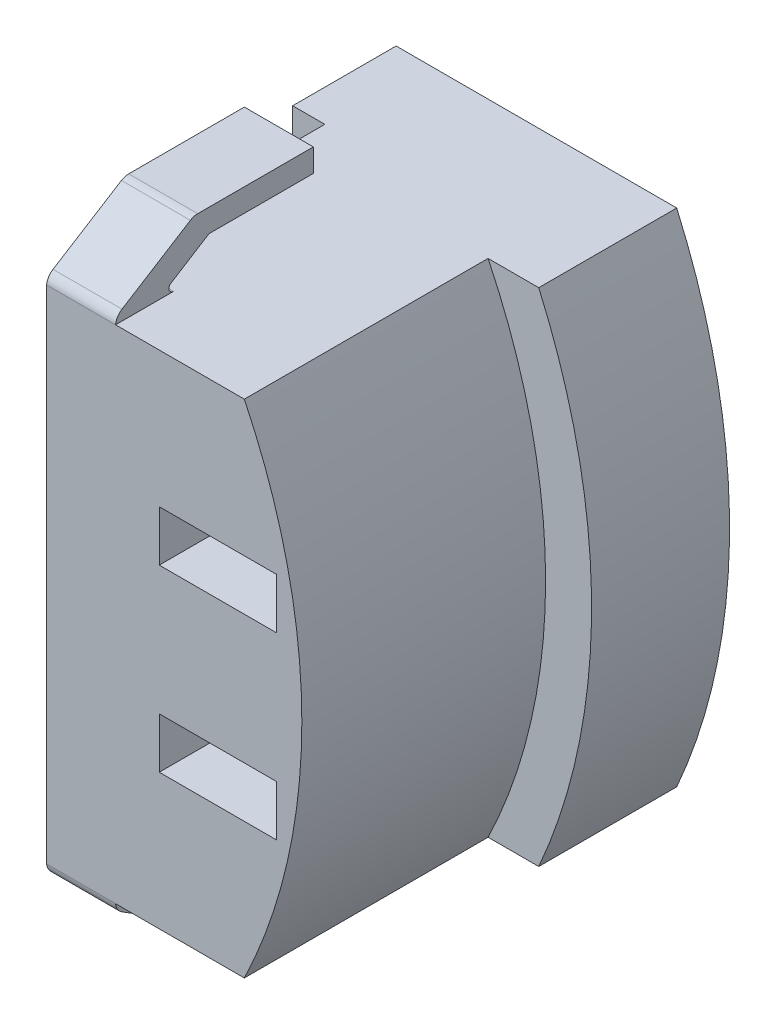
from build123d import *

# Parameters (mm, degrees)
ESQUISSE1_W             = 2.55
ESQUISSE1_H             = 1.1
EXTRUSION1_DEPTH        = 5.3
EXTRUSION2_DEPTH        = 3
ENL_V_MAT_EXTRU_1_DEPTH = 1.95
ESQUISSE4_W             = 0.75
ESQUISSE4_H             = 2.6
ESQUISSE4_W_2           = 1.75
ESQUISSE4_H_2           = 1.1
ENL_V_MAT_EXTRU_2_DEPTH = 5
EXTRUSION3_DEPTH        = 1.5
ESQUISSE6_W             = 5.45
ESQUISSE6_H             = 0.645699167
ENL_V_MAT_EXTRU_3_DEPTH = 0.45
EXTRUSION4_DEPTH        = 1.5
CONG_1_R                = 0.1
EXTRUSION6_DEPTH        = 1.95
EXTRUSION6_DEPTH_BACK   = 0.3
ESQUISSE8_W             = 0.7
ESQUISSE8_H             = 10.9
ESQUISSE9_W             = 2.2
ESQUISSE9_H             = 5
ENL_V_MAT_EXTRU_4_DEPTH = 1.5


with BuildPart() as part:
    # Esquisse1 → Extrusion1 (new body)
    with BuildSketch(Plane.XY):
        with BuildLine():
            Line((6.95, 5.45), (6.95, -5.45))
            Line((6.95, -5.45), (11.249333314, -5.45))
            ThreePointArc((11.249333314, -5.45), (12.5, 0), (11.249333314, 5.45))
            Line((11.249333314, 5.45), (6.95, 5.45))
        make_face()
        with Locations((10.675, 1.95)):
            Rectangle(ESQUISSE1_W, ESQUISSE1_H, mode=Mode.SUBTRACT)
        with Locations((10.675, -1.95)):
            Rectangle(ESQUISSE1_W, ESQUISSE1_H, mode=Mode.SUBTRACT)
    extrude(amount=EXTRUSION1_DEPTH)

    # Esquisse2 → Extrusion2 (add)
    with BuildSketch(Plane(origin=(0, 0, 0), x_dir=(-1, 0, 0), z_dir=(0, 0, -1))):
        with BuildLine():
            Line((-6.95, 5.45), (-12.351012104, 5.45))
            ThreePointArc((-12.351012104, 5.45), (-13.5, 0), (-12.351012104, -5.45))
            Line((-12.351012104, -5.45), (-6.95, -5.45))
            Line((-6.95, -5.45), (-6.95, 5.45))
        make_face()
    extrude(amount=EXTRUSION2_DEPTH)

    # Esquisse3 → Enl_v. mat.-Extru.1 (cut)
    with BuildSketch(Plane(origin=(0, 0, -3), x_dir=(-1, 0, 0), z_dir=(0, 0, -1))):
        with BuildLine():
            Line((-11.891278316, 4.6), (-6.95, 4.6))
            Line((-6.95, 4.6), (-6.95, -4.6))
            Line((-6.95, -4.6), (-11.891278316, -4.6))
            ThreePointArc((-11.891278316, -4.6), (-12.75, 0), (-11.891278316, 4.6))
        make_face()
    extrude(amount=-ENL_V_MAT_EXTRU_1_DEPTH, mode=Mode.SUBTRACT)

    # Esquisse4 → Enl_v. mat.-Extru.2 (cut)
    with BuildSketch(Plane(origin=(0, 0, -1.05), x_dir=(-1, 0, 0), z_dir=(0, 0, -1))):
        with Locations((-8.075, 3.25)):
            Rectangle(ESQUISSE4_W, ESQUISSE4_H)
        with Locations((-8.075, 0)):
            Rectangle(ESQUISSE4_W, ESQUISSE4_H)
        with Locations((-8.075, -3.25)):
            Rectangle(ESQUISSE4_W, ESQUISSE4_H)
        with Locations((-10.225, 4)):
            Rectangle(ESQUISSE4_W_2, ESQUISSE4_H_2)
        with Locations((-10.225, 0)):
            Rectangle(ESQUISSE4_W_2, ESQUISSE4_H_2)
        with Locations((-10.225, -4)):
            Rectangle(ESQUISSE4_W_2, ESQUISSE4_H_2)
    extrude(amount=-ENL_V_MAT_EXTRU_2_DEPTH, mode=Mode.SUBTRACT)

    # Esquisse5 → Extrusion3 (add)
    with BuildSketch(Plane(origin=(0, 0, -1.05), x_dir=(-1, 0, 0), z_dir=(0, 0, -1))):
        Polygon((-8.45, 1.95), (-10.25, 1.95), (-10.25, 2.55), (-11.85, 2.55), (-11.85, 1.95), (-11.05, 1.95), (-11.05, 1.35), (-8.45, 1.35), align=None)
        Polygon((-8.45, -1.3), (-11.05, -1.3), (-11.05, -1.9), (-11.85, -1.9), (-11.85, -2.5), (-10.25, -2.5), (-10.25, -1.9), (-8.45, -1.9), align=None)
    extrude(amount=EXTRUSION3_DEPTH)

    # Esquisse6 → Enl_v. mat.-Extru.3 (cut)
    with BuildSketch(Plane(origin=(0, 0, -3), x_dir=(-1, 0, 0), z_dir=(0, 0, -1))):
        with Locations((-9.175, 4.627150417)):
            Rectangle(ESQUISSE6_W, ESQUISSE6_H)
        with Locations((-9.175, -4.627150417)):
            Rectangle(ESQUISSE6_W, ESQUISSE6_H)
    extrude(amount=-ENL_V_MAT_EXTRU_3_DEPTH, mode=Mode.SUBTRACT)

    # Esquisse7 → Extrusion4 (add)
    with BuildSketch(Plane.ZY.offset(-6.95)):
        with BuildLine():
            Line((5.160427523, -5.674936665), (3.672952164, -6.604414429))
            ThreePointArc((3.672952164, -6.604414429), (3.596667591, -6.638378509), (3.513976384, -6.65))
            Line((3.513976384, -6.65), (1, -6.65))
            Line((1, -6.65), (1, -6.15))
            Line((1, -6.15), (3.267919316, -6.15))
            Line((3.267919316, -6.15), (4.388153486, -5.45))
            Line((4.388153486, -5.45), (5.3, -5.45))
            ThreePointArc((5.3, -5.45), (5.256365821, -5.578695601), (5.160427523, -5.674936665))
        make_face()
    extrusion4 = extrude(amount=-EXTRUSION4_DEPTH)

    # Sym_trie2: Extrusion4 across plane
    add(extrusion4.mirror(Plane.ZX))

    # Cong_1
    cong_1_edges = [part.edges().sort_by_distance(p)[0] for p in [
        (7.7, -5.45, 4.388153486),
        (7.7, 5.45, 4.388153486),
    ]]
    fillet(cong_1_edges, radius=CONG_1_R)

    # Esquisse8 → Extrusion6 (add, two sides: drawn at the far end of the back side and taken through both)
    with BuildSketch(Plane(origin=(0, 0, -1.05), x_dir=(-1, 0, 0), z_dir=(0, 0, -1)).offset(-EXTRUSION6_DEPTH_BACK)):
        with Locations((-6.6, 0)):
            Rectangle(ESQUISSE8_W, ESQUISSE8_H)
    extrude(amount=EXTRUSION6_DEPTH + EXTRUSION6_DEPTH_BACK)

    # Esquisse9 → Enl_v. mat.-Extru.4 (cut)
    with BuildSketch(Plane(origin=(0, 0, -2.55), x_dir=(-1, 0, 0), z_dir=(0, 0, -1))):
        with Locations((-6.15, 0)):
            Rectangle(ESQUISSE9_W, ESQUISSE9_H)
    extrude(amount=ENL_V_MAT_EXTRU_4_DEPTH, mode=Mode.SUBTRACT)


solid = part.part
